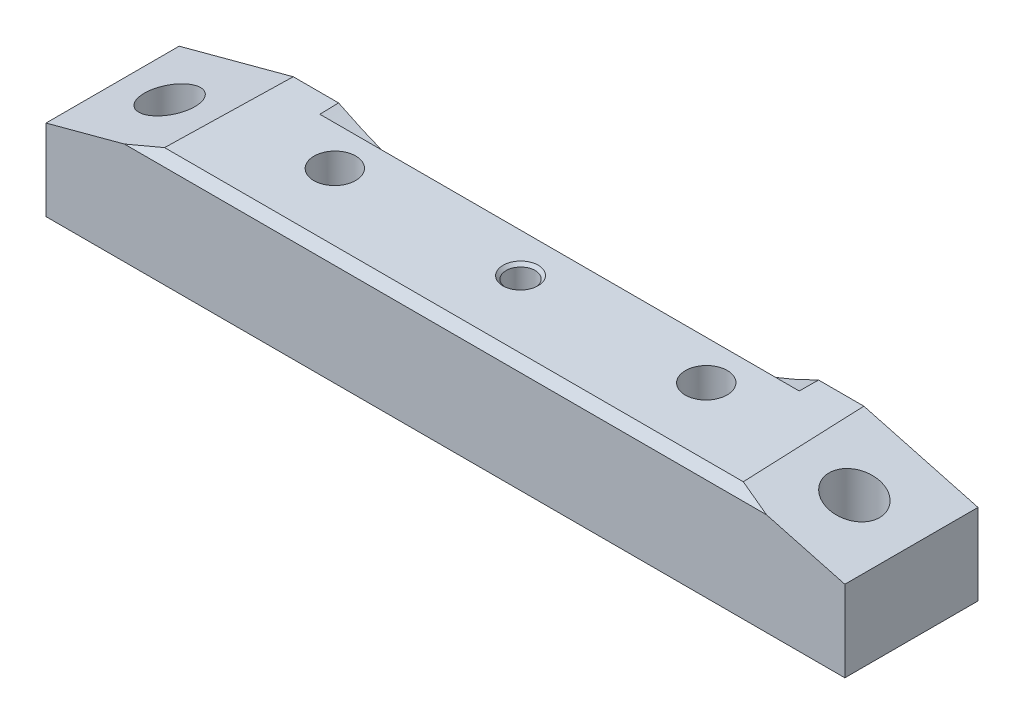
ISO-10303-21;
HEADER;
FILE_DESCRIPTION(('STEP AP214'),'2;1');
FILE_NAME('part.step','',(''),(''),'','','');
FILE_SCHEMA(('AUTOMOTIVE_DESIGN { 1 0 10303 214 1 1 1 1 }'));
ENDSEC;
DATA;
#1=APPLICATION_CONTEXT('core data for automotive mechanical design processes');
#2=APPLICATION_PROTOCOL_DEFINITION('international standard','automotive_design',2000,#1);
#3=PRODUCT_CONTEXT('',#1,'mechanical');
#4=PRODUCT('Part','Part','',(#3));
#5=PRODUCT_RELATED_PRODUCT_CATEGORY('part','',(#4));
#6=PRODUCT_DEFINITION_FORMATION('','',#4);
#7=PRODUCT_DEFINITION_CONTEXT('part definition',#1,'design');
#8=PRODUCT_DEFINITION('design','',#6,#7);
#9=PRODUCT_DEFINITION_SHAPE('','',#8);
#10=(LENGTH_UNIT() NAMED_UNIT(*) SI_UNIT(.MILLI.,.METRE.));
#11=(NAMED_UNIT(*) PLANE_ANGLE_UNIT() SI_UNIT($,.RADIAN.));
#12=(NAMED_UNIT(*) SI_UNIT($,.STERADIAN.) SOLID_ANGLE_UNIT());
#13=UNCERTAINTY_MEASURE_WITH_UNIT(LENGTH_MEASURE(1.E-05),#10,'distance_accuracy_value','');
#14=(GEOMETRIC_REPRESENTATION_CONTEXT(3) GLOBAL_UNCERTAINTY_ASSIGNED_CONTEXT((#13)) GLOBAL_UNIT_ASSIGNED_CONTEXT((#10,
#11,#12)) REPRESENTATION_CONTEXT('',''));
#15=CARTESIAN_POINT('',(0.,0.,0.));
#16=DIRECTION('',(0.,0.,1.));
#17=DIRECTION('',(1.,0.,0.));
#18=AXIS2_PLACEMENT_3D('',#15,#16,#17);
#19=CARTESIAN_POINT('',(0.,15.790709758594,-1.48150229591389));
#20=DIRECTION('',(0.,0.999961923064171,0.00872653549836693));
#21=DIRECTION('',(0.,-0.00872653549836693,0.999961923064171));
#22=AXIS2_PLACEMENT_3D('',#19,#20,#21);
#23=PLANE('',#22);
#24=CARTESIAN_POINT('',(0.,15.790709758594,-1.48150229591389));
#25=DIRECTION('',(0.,0.999961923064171,0.00872653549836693));
#26=DIRECTION('',(0.,-0.00872653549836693,0.999961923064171));
#27=AXIS2_PLACEMENT_3D('',#24,#25,#26);
#28=CIRCLE('',#27,2.4384);
#29=CARTESIAN_POINT('',(0.,15.7694309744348,0.956804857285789));
#30=VERTEX_POINT('',#29);
#31=EDGE_CURVE('E28',#30,#30,#28,.T.);
#32=ORIENTED_EDGE('',*,*,#31,.T.);
#33=EDGE_LOOP('',(#32));
#34=FACE_BOUND('',#33,.T.);
#35=ADVANCED_FACE('F25',(#34),#23,.T.);
#36=CARTESIAN_POINT('',(0.,15.790709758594,-1.48150229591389));
#37=DIRECTION('',(0.,0.999961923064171,0.00872653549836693));
#38=DIRECTION('',(0.,-0.00872653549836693,0.999961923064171));
#39=AXIS2_PLACEMENT_3D('',#36,#37,#38);
#40=CYLINDRICAL_SURFACE('',#39,2.4384);
#41=CARTESIAN_POINT('',(0.,21.632487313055,-1.43052187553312));
#42=DIRECTION('',(0.,0.999961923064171,0.00872653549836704));
#43=DIRECTION('',(0.,-0.00872653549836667,0.999961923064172));
#44=AXIS2_PLACEMENT_3D('',#41,#42,#43);
#45=CIRCLE('',#44,2.43840000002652);
#46=CARTESIAN_POINT('',(0.,21.6112085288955,1.00778527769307));
#47=VERTEX_POINT('',#46);
#48=EDGE_CURVE('E125',#47,#47,#45,.T.);
#49=ORIENTED_EDGE('',*,*,#48,.T.);
#50=EDGE_LOOP('',(#49));
#51=FACE_BOUND('',#50,.T.);
#52=ORIENTED_EDGE('',*,*,#31,.F.);
#53=EDGE_LOOP('',(#52));
#54=FACE_BOUND('',#53,.T.);
#55=ADVANCED_FACE('F350',(#51,#54),#40,.F.);
#56=CARTESIAN_POINT('',(0.,22.1404679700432,-1.42608879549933));
#57=DIRECTION('',(0.,0.999961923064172,0.00872653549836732));
#58=DIRECTION('',(0.,-0.00872653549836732,0.999961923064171));
#59=AXIS2_PLACEMENT_3D('',#56,#57,#58);
#60=CONICAL_SURFACE('',#59,2.94640000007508,0.785398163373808);
#61=CARTESIAN_POINT('',(0.,22.1404679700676,-1.42608879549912));
#62=DIRECTION('',(0.,0.999961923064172,0.00872653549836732));
#63=DIRECTION('',(0.,-0.00872653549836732,0.999961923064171));
#64=AXIS2_PLACEMENT_3D('',#61,#62,#63);
#65=CIRCLE('',#64,2.94640000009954);
#66=CARTESIAN_POINT('',(0.,22.1147561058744,1.5201990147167));
#67=VERTEX_POINT('',#66);
#68=EDGE_CURVE('E100',#67,#67,#65,.T.);
#69=ORIENTED_EDGE('',*,*,#68,.T.);
#70=EDGE_LOOP('',(#69));
#71=FACE_BOUND('',#70,.T.);
#72=ORIENTED_EDGE('',*,*,#48,.F.);
#73=EDGE_LOOP('',(#72));
#74=FACE_BOUND('',#73,.T.);
#75=ADVANCED_FACE('F348',(#71,#74),#60,.F.);
#76=CARTESIAN_POINT('',(0.,101.587019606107,-7.9375));
#77=DIRECTION('',(0.,0.,-1.));
#78=DIRECTION('',(-1.,0.,0.));
#79=AXIS2_PLACEMENT_3D('',#76,#77,#78);
#80=PLANE('',#79);
#81=DIRECTION('',(1.,0.,0.));
#82=VECTOR('',#81,1.);
#83=CARTESIAN_POINT('',(-66.675,22.1972921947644,-7.9375));
#84=LINE('',#83,#82);
#85=CARTESIAN_POINT('',(-40.0060143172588,22.1972921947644,-7.93750000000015));
#86=VERTEX_POINT('',#85);
#87=CARTESIAN_POINT('',(40.0060143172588,22.1972921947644,-7.93750000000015));
#88=VERTEX_POINT('',#87);
#89=EDGE_CURVE('E99',#86,#88,#84,.T.);
#90=ORIENTED_EDGE('',*,*,#89,.T.);
#91=CARTESIAN_POINT('',(0.,101.587019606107,-7.9375));
#92=DIRECTION('',(0.,0.,-1.));
#93=DIRECTION('',(-1.,0.,0.));
#94=AXIS2_PLACEMENT_3D('',#91,#92,#93);
#95=CIRCLE('',#94,88.9);
#96=EDGE_CURVE('E93',#88,#86,#95,.T.);
#97=ORIENTED_EDGE('',*,*,#96,.T.);
#98=EDGE_LOOP('',(#90,#97));
#99=FACE_BOUND('',#98,.T.);
#100=ADVANCED_FACE('F98',(#99),#80,.T.);
#101=CARTESIAN_POINT('',(-31.0007,22.1404679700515,-1.42608879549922));
#102=DIRECTION('',(0.,0.999961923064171,0.00872653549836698));
#103=DIRECTION('',(0.,-0.00872653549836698,0.999961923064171));
#104=AXIS2_PLACEMENT_3D('',#101,#102,#103);
#105=CYLINDRICAL_SURFACE('',#104,3.5052);
#106=CARTESIAN_POINT('',(-31.0007,12.6158306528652,-1.50920904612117));
#107=DIRECTION('',(0.,0.999961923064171,0.00872653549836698));
#108=DIRECTION('',(0.,-0.00872653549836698,0.999961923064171));
#109=AXIS2_PLACEMENT_3D('',#106,#107,#108);
#110=CIRCLE('',#109,3.5052);
#111=CARTESIAN_POINT('',(-31.0007,12.5852424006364,1.99585748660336));
#112=VERTEX_POINT('',#111);
#113=EDGE_CURVE('E101',#112,#112,#110,.F.);
#114=ORIENTED_EDGE('',*,*,#113,.T.);
#115=EDGE_LOOP('',(#114));
#116=FACE_BOUND('',#115,.T.);
#117=CARTESIAN_POINT('',(-31.0007,22.1404679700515,-1.42608879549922));
#118=DIRECTION('',(0.,0.999961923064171,0.00872653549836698));
#119=DIRECTION('',(0.,-0.00872653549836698,0.999961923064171));
#120=AXIS2_PLACEMENT_3D('',#117,#118,#119);
#121=CIRCLE('',#120,3.5052);
#122=CARTESIAN_POINT('',(-31.0007,22.1098797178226,2.07897773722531));
#123=VERTEX_POINT('',#122);
#124=EDGE_CURVE('E175',#123,#123,#121,.T.);
#125=ORIENTED_EDGE('',*,*,#124,.T.);
#126=EDGE_LOOP('',(#125));
#127=FACE_BOUND('',#126,.T.);
#128=ADVANCED_FACE('F342',(#116,#127),#105,.F.);
#129=CARTESIAN_POINT('',(31.0007,22.1404679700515,-1.42608879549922));
#130=DIRECTION('',(0.,0.999961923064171,0.00872653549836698));
#131=DIRECTION('',(0.,-0.00872653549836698,0.999961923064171));
#132=AXIS2_PLACEMENT_3D('',#129,#130,#131);
#133=CYLINDRICAL_SURFACE('',#132,3.5052);
#134=CARTESIAN_POINT('',(31.0007,12.6158306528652,-1.50920904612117));
#135=DIRECTION('',(0.,0.999961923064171,0.00872653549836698));
#136=DIRECTION('',(0.,-0.00872653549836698,0.999961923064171));
#137=AXIS2_PLACEMENT_3D('',#134,#135,#136);
#138=CIRCLE('',#137,3.5052);
#139=CARTESIAN_POINT('',(31.0007,12.5852424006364,1.99585748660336));
#140=VERTEX_POINT('',#139);
#141=EDGE_CURVE('E123',#140,#140,#138,.F.);
#142=ORIENTED_EDGE('',*,*,#141,.T.);
#143=EDGE_LOOP('',(#142));
#144=FACE_BOUND('',#143,.T.);
#145=CARTESIAN_POINT('',(31.0007,22.1404679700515,-1.42608879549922));
#146=DIRECTION('',(0.,0.999961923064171,0.00872653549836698));
#147=DIRECTION('',(0.,-0.00872653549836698,0.999961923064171));
#148=AXIS2_PLACEMENT_3D('',#145,#146,#147);
#149=CIRCLE('',#148,3.5052);
#150=CARTESIAN_POINT('',(31.0007,22.1098797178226,2.07897773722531));
#151=VERTEX_POINT('',#150);
#152=EDGE_CURVE('E172',#151,#151,#149,.T.);
#153=ORIENTED_EDGE('',*,*,#152,.T.);
#154=EDGE_LOOP('',(#153));
#155=FACE_BOUND('',#154,.T.);
#156=ADVANCED_FACE('F338',(#144,#155),#133,.F.);
#157=CARTESIAN_POINT('',(31.0007,12.6158306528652,-1.50920904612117));
#158=DIRECTION('',(0.,0.999961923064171,0.00872653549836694));
#159=DIRECTION('',(0.,-0.00872653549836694,0.999961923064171));
#160=AXIS2_PLACEMENT_3D('',#157,#158,#159);
#161=PLANE('',#160);
#162=CARTESIAN_POINT('',(31.0007,12.6158306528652,-1.50920904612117));
#163=DIRECTION('',(0.,0.999961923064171,0.00872653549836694));
#164=DIRECTION('',(0.,-0.00872653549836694,0.999961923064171));
#165=AXIS2_PLACEMENT_3D('',#162,#163,#164);
#166=CIRCLE('',#165,6.99770000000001);
#167=CARTESIAN_POINT('',(31.0007,12.5547649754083,5.48822450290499));
#168=VERTEX_POINT('',#167);
#169=EDGE_CURVE('E168',#168,#168,#166,.F.);
#170=ORIENTED_EDGE('',*,*,#169,.T.);
#171=EDGE_LOOP('',(#170));
#172=FACE_BOUND('',#171,.T.);
#173=ORIENTED_EDGE('',*,*,#141,.F.);
#174=EDGE_LOOP('',(#173));
#175=FACE_BOUND('',#174,.T.);
#176=ADVANCED_FACE('F334',(#172,#175),#161,.F.);
#177=CARTESIAN_POINT('',(-31.0007,12.6158306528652,-1.50920904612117));
#178=DIRECTION('',(0.,0.999961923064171,0.00872653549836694));
#179=DIRECTION('',(0.,-0.00872653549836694,0.999961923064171));
#180=AXIS2_PLACEMENT_3D('',#177,#178,#179);
#181=PLANE('',#180);
#182=CARTESIAN_POINT('',(-31.0007,12.6158306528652,-1.50920904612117));
#183=DIRECTION('',(0.,0.999961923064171,0.00872653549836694));
#184=DIRECTION('',(0.,-0.00872653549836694,0.999961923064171));
#185=AXIS2_PLACEMENT_3D('',#182,#183,#184);
#186=CIRCLE('',#185,6.9977);
#187=CARTESIAN_POINT('',(-31.0007,12.5547649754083,5.48822450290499));
#188=VERTEX_POINT('',#187);
#189=EDGE_CURVE('E165',#188,#188,#186,.F.);
#190=ORIENTED_EDGE('',*,*,#189,.T.);
#191=EDGE_LOOP('',(#190));
#192=FACE_BOUND('',#191,.T.);
#193=ORIENTED_EDGE('',*,*,#113,.F.);
#194=EDGE_LOOP('',(#193));
#195=FACE_BOUND('',#194,.T.);
#196=ADVANCED_FACE('F330',(#192,#195),#181,.F.);
#197=CARTESIAN_POINT('',(0.,14.7143613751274,0.));
#198=DIRECTION('',(0.,-1.,0.));
#199=DIRECTION('',(0.,0.,-1.));
#200=AXIS2_PLACEMENT_3D('',#197,#198,#199);
#201=PLANE('',#200);
#202=CARTESIAN_POINT('',(0.,14.7143613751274,0.));
#203=DIRECTION('',(0.,-1.,0.));
#204=DIRECTION('',(0.,0.,-1.));
#205=AXIS2_PLACEMENT_3D('',#202,#203,#204);
#206=CIRCLE('',#205,3.16865);
#207=CARTESIAN_POINT('',(0.,14.7143613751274,-3.16865));
#208=VERTEX_POINT('',#207);
#209=EDGE_CURVE('E162',#208,#208,#206,.T.);
#210=ORIENTED_EDGE('',*,*,#209,.T.);
#211=EDGE_LOOP('',(#210));
#212=FACE_BOUND('',#211,.T.);
#213=ADVANCED_FACE('F327',(#212),#201,.T.);
#214=CARTESIAN_POINT('',(0.,101.587019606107,-7.9375));
#215=DIRECTION('',(0.,0.,-1.));
#216=DIRECTION('',(-1.,0.,0.));
#217=AXIS2_PLACEMENT_3D('',#214,#215,#216);
#218=CYLINDRICAL_SURFACE('',#217,88.9);
#219=CARTESIAN_POINT('',(0.,101.587019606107,-9105.09919820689));
#220=DIRECTION('',(0.,-0.999961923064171,-0.00872653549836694));
#221=DIRECTION('',(0.,0.00872653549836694,-0.999961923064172));
#222=AXIS2_PLACEMENT_3D('',#219,#220,#221);
#223=ELLIPSE('',#222,10187.3188983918,88.9);
#224=CARTESIAN_POINT('',(-40.0609516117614,22.225,-11.1124999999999));
#225=VERTEX_POINT('',#224);
#226=EDGE_CURVE('E107',#225,#86,#223,.F.);
#227=ORIENTED_EDGE('',*,*,#226,.T.);
#228=ORIENTED_EDGE('',*,*,#96,.F.);
#229=CARTESIAN_POINT('',(0.,101.587019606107,-9105.09919820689));
#230=DIRECTION('',(0.,-0.999961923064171,-0.00872653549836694));
#231=DIRECTION('',(0.,0.00872653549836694,-0.999961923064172));
#232=AXIS2_PLACEMENT_3D('',#229,#230,#231);
#233=ELLIPSE('',#232,10187.3188983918,88.9);
#234=CARTESIAN_POINT('',(40.0609516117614,22.225,-11.1124999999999));
#235=VERTEX_POINT('',#234);
#236=EDGE_CURVE('E110',#88,#235,#233,.F.);
#237=ORIENTED_EDGE('',*,*,#236,.T.);
#238=CARTESIAN_POINT('',(0.,101.587019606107,-11.1125));
#239=DIRECTION('',(0.,0.,-1.));
#240=DIRECTION('',(-1.,0.,0.));
#241=AXIS2_PLACEMENT_3D('',#238,#239,#240);
#242=CIRCLE('',#241,88.9);
#243=EDGE_CURVE('E115',#235,#225,#242,.T.);
#244=ORIENTED_EDGE('',*,*,#243,.T.);
#245=EDGE_LOOP('',(#227,#228,#237,#244));
#246=FACE_BOUND('',#245,.T.);
#247=ADVANCED_FACE('F113',(#246),#218,.F.);
#248=CARTESIAN_POINT('',(-66.675,22.0310453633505,11.1125));
#249=DIRECTION('',(0.,-0.999961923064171,-0.00872653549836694));
#250=DIRECTION('',(0.,0.00872653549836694,-0.999961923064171));
#251=AXIS2_PLACEMENT_3D('',#248,#249,#250);
#252=PLANE('',#251);
#253=ORIENTED_EDGE('',*,*,#152,.F.);
#254=EDGE_LOOP('',(#253));
#255=FACE_BOUND('',#254,.T.);
#256=ORIENTED_EDGE('',*,*,#124,.F.);
#257=EDGE_LOOP('',(#256));
#258=FACE_BOUND('',#257,.T.);
#259=DIRECTION('',(1.,0.,0.));
#260=VECTOR('',#259,1.);
#261=CARTESIAN_POINT('',(-66.676,22.0434255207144,9.69387447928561));
#262=LINE('',#261,#260);
#263=CARTESIAN_POINT('',(-48.3026451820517,22.0434255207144,9.69387447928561));
#264=VERTEX_POINT('',#263);
#265=CARTESIAN_POINT('',(48.3026451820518,22.0434255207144,9.6938744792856));
#266=VERTEX_POINT('',#265);
#267=EDGE_CURVE('E174',#264,#266,#262,.T.);
#268=ORIENTED_EDGE('',*,*,#267,.T.);
#269=DIRECTION('',(-0.0325506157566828,0.00872191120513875,-0.999432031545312));
#270=VECTOR('',#269,1.);
#271=CARTESIAN_POINT('',(48.3026451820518,22.0434255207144,9.6938744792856));
#272=LINE('',#271,#270);
#273=CARTESIAN_POINT('',(47.625,22.225,-11.1125));
#274=VERTEX_POINT('',#273);
#275=EDGE_CURVE('E171',#266,#274,#272,.T.);
#276=ORIENTED_EDGE('',*,*,#275,.T.);
#277=DIRECTION('',(1.,0.,0.));
#278=VECTOR('',#277,1.);
#279=CARTESIAN_POINT('',(0.,22.225,-11.1125));
#280=LINE('',#279,#278);
#281=EDGE_CURVE('E154',#274,#235,#280,.F.);
#282=ORIENTED_EDGE('',*,*,#281,.T.);
#283=ORIENTED_EDGE('',*,*,#236,.F.);
#284=ORIENTED_EDGE('',*,*,#89,.F.);
#285=ORIENTED_EDGE('',*,*,#226,.F.);
#286=DIRECTION('',(1.,0.,0.));
#287=VECTOR('',#286,1.);
#288=CARTESIAN_POINT('',(0.,22.225,-11.1125));
#289=LINE('',#288,#287);
#290=CARTESIAN_POINT('',(-47.6249999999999,22.225,-11.1125));
#291=VERTEX_POINT('',#290);
#292=EDGE_CURVE('E153',#225,#291,#289,.F.);
#293=ORIENTED_EDGE('',*,*,#292,.T.);
#294=DIRECTION('',(-0.0325506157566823,-0.00872191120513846,0.999432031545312));
#295=VECTOR('',#294,1.);
#296=CARTESIAN_POINT('',(-47.625,22.225,-11.1124999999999));
#297=LINE('',#296,#295);
#298=EDGE_CURVE('E212',#291,#264,#297,.T.);
#299=ORIENTED_EDGE('',*,*,#298,.T.);
#300=EDGE_LOOP('',(#268,#276,#282,#283,#284,#285,#293,#299));
#301=FACE_BOUND('',#300,.T.);
#302=ORIENTED_EDGE('',*,*,#68,.F.);
#303=EDGE_LOOP('',(#302));
#304=FACE_BOUND('',#303,.T.);
#305=ADVANCED_FACE('F104',(#255,#258,#301,#304),#252,.F.);
#306=CARTESIAN_POINT('',(-66.676,22.225,9.5123));
#307=DIRECTION('',(0.,-0.707106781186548,-0.707106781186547));
#308=DIRECTION('',(0.,0.707106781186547,-0.707106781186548));
#309=AXIS2_PLACEMENT_3D('',#306,#307,#308);
#310=PLANE('',#309);
#311=DIRECTION('',(1.,0.,0.));
#312=VECTOR('',#311,1.);
#313=CARTESIAN_POINT('',(0.,20.6248,11.1125));
#314=LINE('',#313,#312);
#315=CARTESIAN_POINT('',(53.5970277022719,20.6248,11.1125));
#316=VERTEX_POINT('',#315);
#317=CARTESIAN_POINT('',(-53.5970277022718,20.6248,11.1125));
#318=VERTEX_POINT('',#317);
#319=EDGE_CURVE('E221',#316,#318,#314,.F.);
#320=ORIENTED_EDGE('',*,*,#319,.F.);
#321=DIRECTION('',(-0.935113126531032,0.250562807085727,-0.250562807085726));
#322=VECTOR('',#321,1.);
#323=CARTESIAN_POINT('',(53.5970277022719,20.6248,11.1125));
#324=LINE('',#323,#322);
#325=EDGE_CURVE('E200',#316,#266,#324,.T.);
#326=ORIENTED_EDGE('',*,*,#325,.T.);
#327=ORIENTED_EDGE('',*,*,#267,.F.);
#328=DIRECTION('',(-0.935113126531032,-0.250562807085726,0.250562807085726));
#329=VECTOR('',#328,1.);
#330=CARTESIAN_POINT('',(-48.3026451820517,22.0434255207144,9.69387447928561));
#331=LINE('',#330,#329);
#332=EDGE_CURVE('E215',#264,#318,#331,.T.);
#333=ORIENTED_EDGE('',*,*,#332,.T.);
#334=EDGE_LOOP('',(#320,#326,#327,#333));
#335=FACE_BOUND('',#334,.T.);
#336=ADVANCED_FACE('F252',(#335),#310,.F.);
#337=CARTESIAN_POINT('',(-66.675,17.1205678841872,-11.1135));
#338=DIRECTION('',(0.258819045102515,-0.96592582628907,0.));
#339=DIRECTION('',(0.96592582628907,0.258819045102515,0.));
#340=AXIS2_PLACEMENT_3D('',#337,#338,#339);
#341=PLANE('',#340);
#342=ORIENTED_EDGE('',*,*,#332,.F.);
#343=ORIENTED_EDGE('',*,*,#298,.F.);
#344=DIRECTION('',(-0.96592582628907,-0.258819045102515,0.));
#345=VECTOR('',#344,1.);
#346=CARTESIAN_POINT('',(-47.625,22.225,-11.1125));
#347=LINE('',#346,#345);
#348=CARTESIAN_POINT('',(-66.675,17.1205678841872,-11.1125));
#349=VERTEX_POINT('',#348);
#350=EDGE_CURVE('E158',#291,#349,#347,.T.);
#351=ORIENTED_EDGE('',*,*,#350,.T.);
#352=DIRECTION('',(0.,0.,-1.));
#353=VECTOR('',#352,1.);
#354=CARTESIAN_POINT('',(-66.675,17.1205678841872,11.1125));
#355=LINE('',#354,#353);
#356=CARTESIAN_POINT('',(-66.675,17.1205678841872,11.1125));
#357=VERTEX_POINT('',#356);
#358=EDGE_CURVE('E218',#349,#357,#355,.F.);
#359=ORIENTED_EDGE('',*,*,#358,.T.);
#360=DIRECTION('',(-0.96592582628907,-0.258819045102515,0.));
#361=VECTOR('',#360,1.);
#362=CARTESIAN_POINT('',(-53.5970277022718,20.6248,11.1125));
#363=LINE('',#362,#361);
#364=EDGE_CURVE('E243',#318,#357,#363,.T.);
#365=ORIENTED_EDGE('',*,*,#364,.F.);
#366=EDGE_LOOP('',(#342,#343,#351,#359,#365));
#367=FACE_BOUND('',#366,.T.);
#368=CARTESIAN_POINT('',(-57.15,19.6727839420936,0.));
#369=DIRECTION('',(0.258819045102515,-0.96592582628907,0.));
#370=DIRECTION('',(-0.96592582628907,-0.258819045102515,0.));
#371=AXIS2_PLACEMENT_3D('',#368,#369,#370);
#372=ELLIPSE('',#371,4.36513848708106,4.21639999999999);
#373=CARTESIAN_POINT('',(-61.3664,18.5430029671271,0.));
#374=VERTEX_POINT('',#373);
#375=EDGE_CURVE('E159',#374,#374,#372,.T.);
#376=ORIENTED_EDGE('',*,*,#375,.T.);
#377=EDGE_LOOP('',(#376));
#378=FACE_BOUND('',#377,.T.);
#379=ADVANCED_FACE('F254',(#367,#378),#341,.F.);
#380=CARTESIAN_POINT('',(47.625,22.225,-11.1135));
#381=DIRECTION('',(-0.258819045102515,-0.96592582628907,0.));
#382=DIRECTION('',(0.96592582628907,-0.258819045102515,0.));
#383=AXIS2_PLACEMENT_3D('',#380,#381,#382);
#384=PLANE('',#383);
#385=ORIENTED_EDGE('',*,*,#325,.F.);
#386=DIRECTION('',(-0.96592582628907,0.258819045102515,0.));
#387=VECTOR('',#386,1.);
#388=CARTESIAN_POINT('',(66.675,17.1205678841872,11.1125));
#389=LINE('',#388,#387);
#390=CARTESIAN_POINT('',(66.675,17.1205678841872,11.1125));
#391=VERTEX_POINT('',#390);
#392=EDGE_CURVE('E236',#391,#316,#389,.T.);
#393=ORIENTED_EDGE('',*,*,#392,.F.);
#394=DIRECTION('',(0.,0.,1.));
#395=VECTOR('',#394,1.);
#396=CARTESIAN_POINT('',(66.675,17.1205678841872,11.1125));
#397=LINE('',#396,#395);
#398=CARTESIAN_POINT('',(66.675,17.1205678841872,-11.1125));
#399=VERTEX_POINT('',#398);
#400=EDGE_CURVE('E205',#391,#399,#397,.F.);
#401=ORIENTED_EDGE('',*,*,#400,.T.);
#402=DIRECTION('',(-0.96592582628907,0.258819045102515,0.));
#403=VECTOR('',#402,1.);
#404=CARTESIAN_POINT('',(66.675,17.1205678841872,-11.1125));
#405=LINE('',#404,#403);
#406=EDGE_CURVE('E185',#399,#274,#405,.T.);
#407=ORIENTED_EDGE('',*,*,#406,.T.);
#408=ORIENTED_EDGE('',*,*,#275,.F.);
#409=EDGE_LOOP('',(#385,#393,#401,#407,#408));
#410=FACE_BOUND('',#409,.T.);
#411=CARTESIAN_POINT('',(57.15,19.6727839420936,0.));
#412=DIRECTION('',(-0.258819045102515,-0.96592582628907,0.));
#413=DIRECTION('',(0.96592582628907,-0.258819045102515,0.));
#414=AXIS2_PLACEMENT_3D('',#411,#412,#413);
#415=ELLIPSE('',#414,4.36513848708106,4.21639999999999);
#416=CARTESIAN_POINT('',(61.3664,18.5430029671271,0.));
#417=VERTEX_POINT('',#416);
#418=EDGE_CURVE('E155',#417,#417,#415,.T.);
#419=ORIENTED_EDGE('',*,*,#418,.T.);
#420=EDGE_LOOP('',(#419));
#421=FACE_BOUND('',#420,.T.);
#422=ADVANCED_FACE('F278',(#410,#421),#384,.F.);
#423=CARTESIAN_POINT('',(31.0007,3.50503985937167,-1.58871771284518));
#424=DIRECTION('',(0.,0.999961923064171,0.00872653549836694));
#425=DIRECTION('',(0.,-0.00872653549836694,0.999961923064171));
#426=AXIS2_PLACEMENT_3D('',#423,#424,#425);
#427=CYLINDRICAL_SURFACE('',#426,6.99770000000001);
#428=ORIENTED_EDGE('',*,*,#169,.F.);
#429=EDGE_LOOP('',(#428));
#430=FACE_BOUND('',#429,.T.);
#431=CARTESIAN_POINT('',(31.0007,3.58916137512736,-1.58798359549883));
#432=DIRECTION('',(0.,1.,0.));
#433=DIRECTION('',(0.,0.,1.));
#434=AXIS2_PLACEMENT_3D('',#431,#432,#433);
#435=ELLIPSE('',#434,6.99796646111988,6.99770000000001);
#436=CARTESIAN_POINT('',(31.0007,3.58916137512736,5.40998286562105));
#437=VERTEX_POINT('',#436);
#438=EDGE_CURVE('E148',#437,#437,#435,.F.);
#439=ORIENTED_EDGE('',*,*,#438,.T.);
#440=EDGE_LOOP('',(#439));
#441=FACE_BOUND('',#440,.T.);
#442=ADVANCED_FACE('F311',(#430,#441),#427,.F.);
#443=CARTESIAN_POINT('',(-31.0007,3.50503985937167,-1.58871771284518));
#444=DIRECTION('',(0.,0.999961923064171,0.00872653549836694));
#445=DIRECTION('',(0.,-0.00872653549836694,0.999961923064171));
#446=AXIS2_PLACEMENT_3D('',#443,#444,#445);
#447=CYLINDRICAL_SURFACE('',#446,6.9977);
#448=ORIENTED_EDGE('',*,*,#189,.F.);
#449=EDGE_LOOP('',(#448));
#450=FACE_BOUND('',#449,.T.);
#451=CARTESIAN_POINT('',(-31.0007,3.58916137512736,-1.58798359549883));
#452=DIRECTION('',(0.,1.,0.));
#453=DIRECTION('',(0.,0.,1.));
#454=AXIS2_PLACEMENT_3D('',#451,#452,#453);
#455=ELLIPSE('',#454,6.99796646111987,6.9977);
#456=CARTESIAN_POINT('',(-31.0007,3.58916137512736,5.40998286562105));
#457=VERTEX_POINT('',#456);
#458=EDGE_CURVE('E145',#457,#457,#455,.F.);
#459=ORIENTED_EDGE('',*,*,#458,.T.);
#460=EDGE_LOOP('',(#459));
#461=FACE_BOUND('',#460,.T.);
#462=ADVANCED_FACE('F307',(#450,#461),#447,.F.);
#463=CARTESIAN_POINT('',(0.,14.7143613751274,0.));
#464=DIRECTION('',(0.,-1.,0.));
#465=DIRECTION('',(0.,0.,-1.));
#466=AXIS2_PLACEMENT_3D('',#463,#464,#465);
#467=CYLINDRICAL_SURFACE('',#466,3.16865);
#468=ORIENTED_EDGE('',*,*,#209,.F.);
#469=EDGE_LOOP('',(#468));
#470=FACE_BOUND('',#469,.T.);
#471=CARTESIAN_POINT('',(0.,3.58916137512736,0.));
#472=DIRECTION('',(0.,-1.,0.));
#473=DIRECTION('',(0.,0.,-1.));
#474=AXIS2_PLACEMENT_3D('',#471,#472,#473);
#475=CIRCLE('',#474,3.16865);
#476=CARTESIAN_POINT('',(0.,3.58916137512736,-3.16865));
#477=VERTEX_POINT('',#476);
#478=EDGE_CURVE('E142',#477,#477,#475,.T.);
#479=ORIENTED_EDGE('',*,*,#478,.T.);
#480=EDGE_LOOP('',(#479));
#481=FACE_BOUND('',#480,.T.);
#482=ADVANCED_FACE('F303',(#470,#481),#467,.F.);
#483=CARTESIAN_POINT('',(-57.15,3.58916137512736,0.));
#484=DIRECTION('',(0.,-1.,0.));
#485=DIRECTION('',(0.,0.,-1.));
#486=AXIS2_PLACEMENT_3D('',#483,#484,#485);
#487=CYLINDRICAL_SURFACE('',#486,4.21639999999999);
#488=ORIENTED_EDGE('',*,*,#375,.F.);
#489=EDGE_LOOP('',(#488));
#490=FACE_BOUND('',#489,.T.);
#491=CARTESIAN_POINT('',(-57.15,3.58916137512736,0.));
#492=DIRECTION('',(0.,-1.,0.));
#493=DIRECTION('',(0.,0.,-1.));
#494=AXIS2_PLACEMENT_3D('',#491,#492,#493);
#495=CIRCLE('',#494,4.21639999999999);
#496=CARTESIAN_POINT('',(-57.15,3.58916137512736,-4.21639999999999));
#497=VERTEX_POINT('',#496);
#498=EDGE_CURVE('E139',#497,#497,#495,.T.);
#499=ORIENTED_EDGE('',*,*,#498,.T.);
#500=EDGE_LOOP('',(#499));
#501=FACE_BOUND('',#500,.T.);
#502=ADVANCED_FACE('F299',(#490,#501),#487,.F.);
#503=CARTESIAN_POINT('',(57.15,3.58916137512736,0.));
#504=DIRECTION('',(0.,-1.,0.));
#505=DIRECTION('',(0.,0.,-1.));
#506=AXIS2_PLACEMENT_3D('',#503,#504,#505);
#507=CYLINDRICAL_SURFACE('',#506,4.21639999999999);
#508=ORIENTED_EDGE('',*,*,#418,.F.);
#509=EDGE_LOOP('',(#508));
#510=FACE_BOUND('',#509,.T.);
#511=CARTESIAN_POINT('',(57.15,3.58916137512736,0.));
#512=DIRECTION('',(0.,-1.,0.));
#513=DIRECTION('',(0.,0.,-1.));
#514=AXIS2_PLACEMENT_3D('',#511,#512,#513);
#515=CIRCLE('',#514,4.21639999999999);
#516=CARTESIAN_POINT('',(57.15,3.58916137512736,-4.21639999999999));
#517=VERTEX_POINT('',#516);
#518=EDGE_CURVE('E135',#517,#517,#515,.T.);
#519=ORIENTED_EDGE('',*,*,#518,.T.);
#520=EDGE_LOOP('',(#519));
#521=FACE_BOUND('',#520,.T.);
#522=ADVANCED_FACE('F296',(#510,#521),#507,.F.);
#523=CARTESIAN_POINT('',(0.,0.,-11.1125));
#524=DIRECTION('',(0.,0.,1.));
#525=DIRECTION('',(1.,0.,0.));
#526=AXIS2_PLACEMENT_3D('',#523,#524,#525);
#527=PLANE('',#526);
#528=ORIENTED_EDGE('',*,*,#243,.F.);
#529=ORIENTED_EDGE('',*,*,#281,.F.);
#530=ORIENTED_EDGE('',*,*,#406,.F.);
#531=DIRECTION('',(0.,1.,0.));
#532=VECTOR('',#531,1.);
#533=CARTESIAN_POINT('',(66.675,22.225,-11.1125));
#534=LINE('',#533,#532);
#535=CARTESIAN_POINT('',(66.675,3.58916137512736,-11.1125));
#536=VERTEX_POINT('',#535);
#537=EDGE_CURVE('E151',#399,#536,#534,.F.);
#538=ORIENTED_EDGE('',*,*,#537,.T.);
#539=DIRECTION('',(1.,0.,0.));
#540=VECTOR('',#539,1.);
#541=CARTESIAN_POINT('',(-66.675,3.58916137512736,-11.1125));
#542=LINE('',#541,#540);
#543=CARTESIAN_POINT('',(-66.675,3.58916137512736,-11.1125));
#544=VERTEX_POINT('',#543);
#545=EDGE_CURVE('E138',#536,#544,#542,.F.);
#546=ORIENTED_EDGE('',*,*,#545,.T.);
#547=DIRECTION('',(0.,1.,0.));
#548=VECTOR('',#547,1.);
#549=CARTESIAN_POINT('',(-66.675,22.225,-11.1125));
#550=LINE('',#549,#548);
#551=EDGE_CURVE('E222',#544,#349,#550,.T.);
#552=ORIENTED_EDGE('',*,*,#551,.T.);
#553=ORIENTED_EDGE('',*,*,#350,.F.);
#554=ORIENTED_EDGE('',*,*,#292,.F.);
#555=EDGE_LOOP('',(#528,#529,#530,#538,#546,#552,#553,#554));
#556=FACE_BOUND('',#555,.T.);
#557=ADVANCED_FACE('F181',(#556),#527,.F.);
#558=CARTESIAN_POINT('',(-66.675,22.225,11.1125));
#559=DIRECTION('',(1.,0.,0.));
#560=DIRECTION('',(0.,0.,-1.));
#561=AXIS2_PLACEMENT_3D('',#558,#559,#560);
#562=PLANE('',#561);
#563=ORIENTED_EDGE('',*,*,#358,.F.);
#564=ORIENTED_EDGE('',*,*,#551,.F.);
#565=DIRECTION('',(0.,0.,1.));
#566=VECTOR('',#565,1.);
#567=CARTESIAN_POINT('',(-66.675,3.58916137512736,11.1125));
#568=LINE('',#567,#566);
#569=CARTESIAN_POINT('',(-66.675,3.58916137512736,11.1125));
#570=VERTEX_POINT('',#569);
#571=EDGE_CURVE('E267',#544,#570,#568,.T.);
#572=ORIENTED_EDGE('',*,*,#571,.T.);
#573=DIRECTION('',(0.,1.,0.));
#574=VECTOR('',#573,1.);
#575=CARTESIAN_POINT('',(-66.675,0.,11.1125));
#576=LINE('',#575,#574);
#577=EDGE_CURVE('E239',#357,#570,#576,.F.);
#578=ORIENTED_EDGE('',*,*,#577,.F.);
#579=EDGE_LOOP('',(#563,#564,#572,#578));
#580=FACE_BOUND('',#579,.T.);
#581=ADVANCED_FACE('F266',(#580),#562,.F.);
#582=CARTESIAN_POINT('',(0.,0.,11.1125));
#583=DIRECTION('',(0.,0.,1.));
#584=DIRECTION('',(1.,0.,0.));
#585=AXIS2_PLACEMENT_3D('',#582,#583,#584);
#586=PLANE('',#585);
#587=DIRECTION('',(0.,1.,0.));
#588=VECTOR('',#587,1.);
#589=CARTESIAN_POINT('',(66.675,22.225,11.1125));
#590=LINE('',#589,#588);
#591=CARTESIAN_POINT('',(66.675,3.58916137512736,11.1125));
#592=VERTEX_POINT('',#591);
#593=EDGE_CURVE('E42',#592,#391,#590,.T.);
#594=ORIENTED_EDGE('',*,*,#593,.T.);
#595=ORIENTED_EDGE('',*,*,#392,.T.);
#596=ORIENTED_EDGE('',*,*,#319,.T.);
#597=ORIENTED_EDGE('',*,*,#364,.T.);
#598=ORIENTED_EDGE('',*,*,#577,.T.);
#599=DIRECTION('',(1.,0.,0.));
#600=VECTOR('',#599,1.);
#601=CARTESIAN_POINT('',(-66.675,3.58916137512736,11.1125));
#602=LINE('',#601,#600);
#603=EDGE_CURVE('E34',#570,#592,#602,.T.);
#604=ORIENTED_EDGE('',*,*,#603,.T.);
#605=EDGE_LOOP('',(#594,#595,#596,#597,#598,#604));
#606=FACE_BOUND('',#605,.T.);
#607=ADVANCED_FACE('F276',(#606),#586,.T.);
#608=CARTESIAN_POINT('',(66.675,22.225,11.1125));
#609=DIRECTION('',(-1.,0.,0.));
#610=DIRECTION('',(0.,0.,1.));
#611=AXIS2_PLACEMENT_3D('',#608,#609,#610);
#612=PLANE('',#611);
#613=ORIENTED_EDGE('',*,*,#400,.F.);
#614=ORIENTED_EDGE('',*,*,#593,.F.);
#615=DIRECTION('',(0.,0.,1.));
#616=VECTOR('',#615,1.);
#617=CARTESIAN_POINT('',(66.675,3.58916137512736,11.1125));
#618=LINE('',#617,#616);
#619=EDGE_CURVE('E13',#592,#536,#618,.F.);
#620=ORIENTED_EDGE('',*,*,#619,.T.);
#621=ORIENTED_EDGE('',*,*,#537,.F.);
#622=EDGE_LOOP('',(#613,#614,#620,#621));
#623=FACE_BOUND('',#622,.T.);
#624=ADVANCED_FACE('F281',(#623),#612,.F.);
#625=CARTESIAN_POINT('',(-66.675,3.58916137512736,11.1125));
#626=DIRECTION('',(0.,1.,0.));
#627=DIRECTION('',(0.,0.,1.));
#628=AXIS2_PLACEMENT_3D('',#625,#626,#627);
#629=PLANE('',#628);
#630=ORIENTED_EDGE('',*,*,#603,.F.);
#631=ORIENTED_EDGE('',*,*,#571,.F.);
#632=ORIENTED_EDGE('',*,*,#545,.F.);
#633=ORIENTED_EDGE('',*,*,#619,.F.);
#634=EDGE_LOOP('',(#630,#631,#632,#633));
#635=FACE_BOUND('',#634,.T.);
#636=ORIENTED_EDGE('',*,*,#518,.F.);
#637=EDGE_LOOP('',(#636));
#638=FACE_BOUND('',#637,.T.);
#639=ORIENTED_EDGE('',*,*,#498,.F.);
#640=EDGE_LOOP('',(#639));
#641=FACE_BOUND('',#640,.T.);
#642=ORIENTED_EDGE('',*,*,#478,.F.);
#643=EDGE_LOOP('',(#642));
#644=FACE_BOUND('',#643,.T.);
#645=ORIENTED_EDGE('',*,*,#458,.F.);
#646=EDGE_LOOP('',(#645));
#647=FACE_BOUND('',#646,.T.);
#648=ORIENTED_EDGE('',*,*,#438,.F.);
#649=EDGE_LOOP('',(#648));
#650=FACE_BOUND('',#649,.T.);
#651=ADVANCED_FACE('F270',(#635,#638,#641,#644,#647,#650),#629,.F.);
#652=CLOSED_SHELL('',(#35,#55,#75,#100,#128,#156,#176,#196,#213,#247,#305,#336,#379,#422,#442,
#462,#482,#502,#522,#557,#581,#607,#624,#651));
#653=MANIFOLD_SOLID_BREP('B1',#652);
#654=ADVANCED_BREP_SHAPE_REPRESENTATION('',(#18,#653),#14);
#655=SHAPE_DEFINITION_REPRESENTATION(#9,#654);
ENDSEC;
END-ISO-10303-21;
